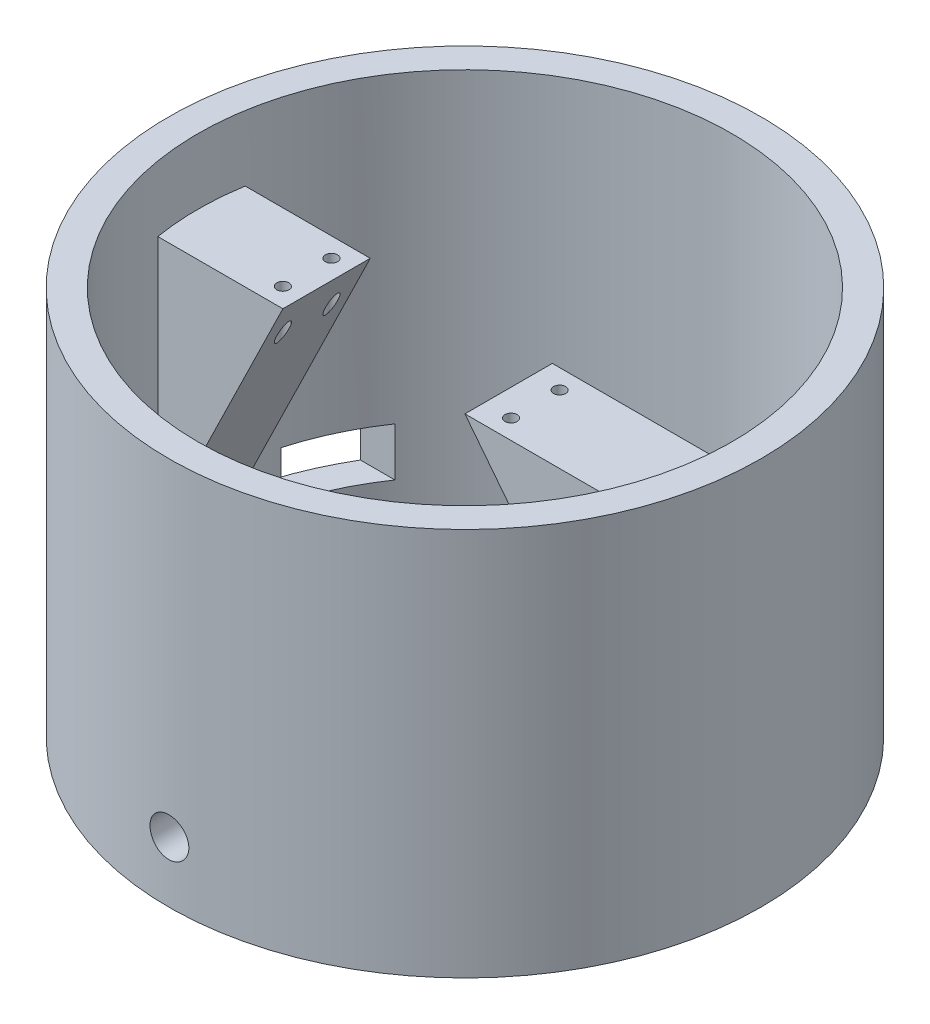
ISO-10303-21;
HEADER;
FILE_DESCRIPTION(('STEP AP214'),'2;1');
FILE_NAME('part.step','',(''),(''),'','','');
FILE_SCHEMA(('AUTOMOTIVE_DESIGN { 1 0 10303 214 1 1 1 1 }'));
ENDSEC;
DATA;
#1=APPLICATION_CONTEXT('core data for automotive mechanical design processes');
#2=APPLICATION_PROTOCOL_DEFINITION('international standard','automotive_design',2000,#1);
#3=PRODUCT_CONTEXT('',#1,'mechanical');
#4=PRODUCT('Part','Part','',(#3));
#5=PRODUCT_RELATED_PRODUCT_CATEGORY('part','',(#4));
#6=PRODUCT_DEFINITION_FORMATION('','',#4);
#7=PRODUCT_DEFINITION_CONTEXT('part definition',#1,'design');
#8=PRODUCT_DEFINITION('design','',#6,#7);
#9=PRODUCT_DEFINITION_SHAPE('','',#8);
#10=(LENGTH_UNIT() NAMED_UNIT(*) SI_UNIT(.MILLI.,.METRE.));
#11=(NAMED_UNIT(*) PLANE_ANGLE_UNIT() SI_UNIT($,.RADIAN.));
#12=(NAMED_UNIT(*) SI_UNIT($,.STERADIAN.) SOLID_ANGLE_UNIT());
#13=UNCERTAINTY_MEASURE_WITH_UNIT(LENGTH_MEASURE(1.E-05),#10,'distance_accuracy_value','');
#14=(GEOMETRIC_REPRESENTATION_CONTEXT(3) GLOBAL_UNCERTAINTY_ASSIGNED_CONTEXT((#13)) GLOBAL_UNIT_ASSIGNED_CONTEXT((#10,
#11,#12)) REPRESENTATION_CONTEXT('',''));
#15=CARTESIAN_POINT('',(0.,0.,0.));
#16=DIRECTION('',(0.,0.,1.));
#17=DIRECTION('',(1.,0.,0.));
#18=AXIS2_PLACEMENT_3D('',#15,#16,#17);
#19=CARTESIAN_POINT('',(0.,80.,0.));
#20=DIRECTION('',(0.,-1.,0.));
#21=DIRECTION('',(0.,0.,-1.));
#22=AXIS2_PLACEMENT_3D('',#19,#20,#21);
#23=CYLINDRICAL_SURFACE('',#22,61.);
#24=CARTESIAN_POINT('',(-4.,12.5,60.8687111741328));
#25=CARTESIAN_POINT('',(-3.99999013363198,12.7244224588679,60.8687129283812));
#26=CARTESIAN_POINT('',(-3.98104948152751,12.9490014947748,60.8699656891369));
#27=CARTESIAN_POINT('',(-3.90576427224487,13.3919567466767,60.8748418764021));
#28=CARTESIAN_POINT('',(-3.84937632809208,13.6103254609,60.8784680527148));
#29=CARTESIAN_POINT('',(-3.70082460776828,14.0343797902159,60.8876785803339));
#30=CARTESIAN_POINT('',(-3.60867989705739,14.2400720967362,60.8932618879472));
#31=CARTESIAN_POINT('',(-3.39126155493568,14.6330170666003,60.905756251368));
#32=CARTESIAN_POINT('',(-3.26599544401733,14.8202739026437,60.91266700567));
#33=CARTESIAN_POINT('',(-2.9856654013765,15.1713928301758,60.9270503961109));
#34=CARTESIAN_POINT('',(-2.8305585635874,15.3352206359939,60.93452383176));
#35=CARTESIAN_POINT('',(-2.4950389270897,15.6345374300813,60.9491830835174));
#36=CARTESIAN_POINT('',(-2.31462506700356,15.7700252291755,60.9563688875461));
#37=CARTESIAN_POINT('',(-1.93341783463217,16.0089224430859,60.9696502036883));
#38=CARTESIAN_POINT('',(-1.73260655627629,16.1123033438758,60.9757447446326));
#39=CARTESIAN_POINT('',(-1.31643027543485,16.2838696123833,60.9861483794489));
#40=CARTESIAN_POINT('',(-1.10106544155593,16.3520553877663,60.9904574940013));
#41=CARTESIAN_POINT('',(-0.662227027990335,16.4512003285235,60.9967992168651));
#42=CARTESIAN_POINT('',(-0.438765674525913,16.4822133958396,60.9988351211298));
#43=CARTESIAN_POINT('',(0.0101996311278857,16.5062990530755,61.0004121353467));
#44=CARTESIAN_POINT('',(0.235703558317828,16.4993721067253,60.9999532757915));
#45=CARTESIAN_POINT('',(0.681987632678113,16.4478187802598,60.9965952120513));
#46=CARTESIAN_POINT('',(0.902774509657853,16.4032503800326,60.9936997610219));
#47=CARTESIAN_POINT('',(1.33372655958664,16.2777692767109,60.9857987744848));
#48=CARTESIAN_POINT('',(1.54389166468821,16.1968563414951,60.9807932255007));
#49=CARTESIAN_POINT('',(1.94782026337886,16.000917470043,60.9692291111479));
#50=CARTESIAN_POINT('',(2.14157099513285,15.8858652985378,60.9626693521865));
#51=CARTESIAN_POINT('',(2.50703161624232,15.6249329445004,60.948734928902));
#52=CARTESIAN_POINT('',(2.6787412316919,15.4790523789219,60.941360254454));
#53=CARTESIAN_POINT('',(2.99558389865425,15.1602768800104,60.9266094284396));
#54=CARTESIAN_POINT('',(3.14066631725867,14.9873316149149,60.9192333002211));
#55=CARTESIAN_POINT('',(3.39974574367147,14.6195122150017,60.905325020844));
#56=CARTESIAN_POINT('',(3.51374273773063,14.4246380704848,60.8987928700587));
#57=CARTESIAN_POINT('',(3.70741196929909,14.0184600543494,60.8873102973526));
#58=CARTESIAN_POINT('',(3.78708201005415,13.8071551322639,60.8823599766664));
#59=CARTESIAN_POINT('',(3.90980050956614,13.37412877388,60.8746028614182));
#60=CARTESIAN_POINT('',(3.95284944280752,13.1524074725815,60.871796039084));
#61=CARTESIAN_POINT('',(4.0010405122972,12.7052840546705,60.8686476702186));
#62=CARTESIAN_POINT('',(4.00625306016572,12.4798895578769,60.868301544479));
#63=CARTESIAN_POINT('',(3.97880742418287,12.0314295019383,60.8701016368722));
#64=CARTESIAN_POINT('',(3.9461494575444,11.8083639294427,60.8722478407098));
#65=CARTESIAN_POINT('',(3.84394834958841,11.3710932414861,60.8787865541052));
#66=CARTESIAN_POINT('',(3.77443769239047,11.1568805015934,60.8831770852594));
#67=CARTESIAN_POINT('',(3.60053727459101,10.743160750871,60.8937080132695));
#68=CARTESIAN_POINT('',(3.496147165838,10.5436538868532,60.8998484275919));
#69=CARTESIAN_POINT('',(3.25527139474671,10.164685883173,60.9131982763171));
#70=CARTESIAN_POINT('',(3.11873858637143,9.98525476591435,60.9204092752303));
#71=CARTESIAN_POINT('',(2.81752163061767,9.65183421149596,60.9350822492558));
#72=CARTESIAN_POINT('',(2.65283718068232,9.49784504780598,60.9425442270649));
#73=CARTESIAN_POINT('',(2.29968852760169,9.21944142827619,60.9568917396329));
#74=CARTESIAN_POINT('',(2.1111883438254,9.09507256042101,60.9637763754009));
#75=CARTESIAN_POINT('',(1.71593977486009,8.87975197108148,60.976180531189));
#76=CARTESIAN_POINT('',(1.50919151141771,8.78880002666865,60.9817000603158));
#77=CARTESIAN_POINT('',(1.08348265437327,8.64297424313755,60.9907478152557));
#78=CARTESIAN_POINT('',(0.864531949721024,8.58807163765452,60.9942776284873));
#79=CARTESIAN_POINT('',(0.420496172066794,8.51580888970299,60.9989545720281));
#80=CARTESIAN_POINT('',(0.195411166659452,8.49844833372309,61.0001017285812));
#81=CARTESIAN_POINT('',(-0.254052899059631,8.50176658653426,60.9998841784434));
#82=CARTESIAN_POINT('',(-0.478432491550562,8.52237409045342,60.9985241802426));
#83=CARTESIAN_POINT('',(-0.920538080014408,8.60089553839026,60.9934545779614));
#84=CARTESIAN_POINT('',(-1.13826406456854,8.65880954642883,60.9897449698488));
#85=CARTESIAN_POINT('',(-1.56089185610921,8.81028364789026,60.9803930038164));
#86=CARTESIAN_POINT('',(-1.76579381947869,8.90384330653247,60.9747506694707));
#87=CARTESIAN_POINT('',(-2.15699099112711,9.12394331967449,60.9621664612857));
#88=CARTESIAN_POINT('',(-2.34328665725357,9.25048286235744,60.9552246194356));
#89=CARTESIAN_POINT('',(-2.69234531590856,9.53321511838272,60.9408065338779));
#90=CARTESIAN_POINT('',(-2.85506631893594,9.68945962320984,60.933329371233));
#91=CARTESIAN_POINT('',(-3.15202761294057,10.0270924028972,60.9186908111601));
#92=CARTESIAN_POINT('',(-3.28626093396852,10.2084868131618,60.9115294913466));
#93=CARTESIAN_POINT('',(-3.52254630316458,10.5914960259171,60.8983229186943));
#94=CARTESIAN_POINT('',(-3.62455559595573,10.7931372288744,60.8922791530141));
#95=CARTESIAN_POINT('',(-3.79314514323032,11.2105790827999,60.8820108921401));
#96=CARTESIAN_POINT('',(-3.85976679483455,11.4263628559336,60.8777842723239));
#97=CARTESIAN_POINT('',(-3.93841916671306,11.786217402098,60.872733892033));
#98=CARTESIAN_POINT('',(-3.96148200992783,11.9279634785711,60.8712321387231));
#99=CARTESIAN_POINT('',(-3.99227556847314,12.2131183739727,60.8692202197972));
#100=CARTESIAN_POINT('',(-4.00000630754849,12.3565271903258,60.8687100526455));
#101=CARTESIAN_POINT('',(-4.,12.5,60.8687111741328));
#102=B_SPLINE_CURVE_WITH_KNOTS('',3,(#24,#25,#26,#27,#28,#29,#30,#31,#32,#33,#34,#35,#36,#37,
#38,#39,#40,#41,#42,#43,#44,#45,#46,#47,#48,#49,#50,#51,#52,#53,#54,#55,#56,#57,#58,#59,#60,#61,
#62,#63,#64,#65,#66,#67,#68,#69,#70,#71,#72,#73,#74,#75,#76,#77,#78,#79,#80,#81,#82,#83,#84,#85,
#86,#87,#88,#89,#90,#91,#92,#93,#94,#95,#96,#97,#98,#99,#100,#101),.UNSPECIFIED.,.T.,.F.,(4,2,2,
2,2,2,2,2,2,2,2,2,2,2,2,2,2,2,2,2,2,2,2,2,2,2,2,2,2,2,2,2,2,2,2,2,2,2,4),(0.,0.672743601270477,
1.346268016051,2.01943380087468,2.69244686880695,3.36643495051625,4.04045130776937,
4.71506455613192,5.38966999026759,6.06329603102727,6.73691383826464,7.40949594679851,
8.08208235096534,8.75518696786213,9.42829994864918,10.10267991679,10.7770601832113,
11.4514836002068,12.1258982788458,12.7990575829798,13.4722130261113,14.1447760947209,
14.8173458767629,15.4909083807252,16.1644781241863,16.8390779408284,17.513673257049,
18.1877296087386,18.8617785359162,19.5345628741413,20.2073483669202,20.8801256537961,
21.5528863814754,22.2268310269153,22.9009403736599,23.5759404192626,24.2501490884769,
24.6802333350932,25.1103169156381),.UNSPECIFIED.);
#103=CARTESIAN_POINT('',(-4.,12.5,60.8687111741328));
#104=VERTEX_POINT('',#103);
#105=EDGE_CURVE('E179',#104,#104,#102,.T.);
#106=ORIENTED_EDGE('',*,*,#105,.T.);
#107=EDGE_LOOP('',(#106));
#108=FACE_BOUND('',#107,.T.);
#109=CARTESIAN_POINT('',(0.,80.,0.));
#110=DIRECTION('',(0.,1.,0.));
#111=DIRECTION('',(1.,0.,0.));
#112=AXIS2_PLACEMENT_3D('',#109,#110,#111);
#113=CIRCLE('',#112,61.);
#114=CARTESIAN_POINT('',(61.,80.,0.));
#115=VERTEX_POINT('',#114);
#116=EDGE_CURVE('E286',#115,#115,#113,.T.);
#117=ORIENTED_EDGE('',*,*,#116,.F.);
#118=EDGE_LOOP('',(#117));
#119=FACE_BOUND('',#118,.T.);
#120=CARTESIAN_POINT('',(0.,0.,0.));
#121=DIRECTION('',(0.,1.,0.));
#122=DIRECTION('',(1.,0.,0.));
#123=AXIS2_PLACEMENT_3D('',#120,#121,#122);
#124=CIRCLE('',#123,61.);
#125=CARTESIAN_POINT('',(61.,0.,0.));
#126=VERTEX_POINT('',#125);
#127=EDGE_CURVE('E289',#126,#126,#124,.T.);
#128=ORIENTED_EDGE('',*,*,#127,.T.);
#129=EDGE_LOOP('',(#128));
#130=FACE_BOUND('',#129,.T.);
#131=DIRECTION('',(0.,-1.,0.));
#132=VECTOR('',#131,1.);
#133=CARTESIAN_POINT('',(-59.1269819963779,80.,-15.));
#134=LINE('',#133,#132);
#135=CARTESIAN_POINT('',(-59.1269819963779,7.49999999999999,-15.));
#136=VERTEX_POINT('',#135);
#137=CARTESIAN_POINT('',(-59.1269819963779,17.5,-15.));
#138=VERTEX_POINT('',#137);
#139=EDGE_CURVE('E176',#136,#138,#134,.F.);
#140=ORIENTED_EDGE('',*,*,#139,.F.);
#141=CARTESIAN_POINT('',(0.,7.49999999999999,0.));
#142=DIRECTION('',(0.,1.,0.));
#143=DIRECTION('',(0.,0.,1.));
#144=AXIS2_PLACEMENT_3D('',#141,#142,#143);
#145=CIRCLE('',#144,61.);
#146=CARTESIAN_POINT('',(-52.5357021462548,7.49999999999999,-31.));
#147=VERTEX_POINT('',#146);
#148=EDGE_CURVE('E165',#147,#136,#145,.T.);
#149=ORIENTED_EDGE('',*,*,#148,.F.);
#150=DIRECTION('',(0.,-1.,0.));
#151=VECTOR('',#150,1.);
#152=CARTESIAN_POINT('',(-52.5357021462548,80.,-31.));
#153=LINE('',#152,#151);
#154=CARTESIAN_POINT('',(-52.5357021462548,17.5,-31.));
#155=VERTEX_POINT('',#154);
#156=EDGE_CURVE('E170',#155,#147,#153,.T.);
#157=ORIENTED_EDGE('',*,*,#156,.F.);
#158=CARTESIAN_POINT('',(0.,17.5,0.));
#159=DIRECTION('',(0.,-1.,0.));
#160=DIRECTION('',(0.,0.,-1.));
#161=AXIS2_PLACEMENT_3D('',#158,#159,#160);
#162=CIRCLE('',#161,61.);
#163=EDGE_CURVE('E182',#138,#155,#162,.T.);
#164=ORIENTED_EDGE('',*,*,#163,.F.);
#165=EDGE_LOOP('',(#140,#149,#157,#164));
#166=FACE_BOUND('',#165,.T.);
#167=ADVANCED_FACE('F77',(#108,#119,#130,#166),#23,.T.);
#168=CARTESIAN_POINT('',(0.,80.,0.));
#169=DIRECTION('',(0.,-1.,0.));
#170=DIRECTION('',(0.,0.,-1.));
#171=AXIS2_PLACEMENT_3D('',#168,#169,#170);
#172=CYLINDRICAL_SURFACE('',#171,55.);
#173=CARTESIAN_POINT('',(-4.,12.5,54.8543526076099));
#174=CARTESIAN_POINT('',(-3.99999015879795,12.724362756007,54.8543545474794));
#175=CARTESIAN_POINT('',(-3.98105953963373,12.9488806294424,54.8557439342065));
#176=CARTESIAN_POINT('',(-3.90581651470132,13.3917111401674,54.8611516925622));
#177=CARTESIAN_POINT('',(-3.84946112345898,13.6100163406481,54.8651730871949));
#178=CARTESIAN_POINT('',(-3.70100094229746,14.0339433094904,54.8753869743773));
#179=CARTESIAN_POINT('',(-3.60891565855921,14.2395719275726,54.8815782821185));
#180=CARTESIAN_POINT('',(-3.39164268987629,14.6324020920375,54.8954328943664));
#181=CARTESIAN_POINT('',(-3.26646235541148,14.8196077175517,54.903095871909));
#182=CARTESIAN_POINT('',(-2.98628221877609,15.1707014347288,54.9190475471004));
#183=CARTESIAN_POINT('',(-2.83123037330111,15.3345479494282,54.9273373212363));
#184=CARTESIAN_POINT('',(-2.49581753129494,15.6339158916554,54.9435986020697));
#185=CARTESIAN_POINT('',(-2.31545545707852,15.7694361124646,54.9515700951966));
#186=CARTESIAN_POINT('',(-1.93430016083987,16.0084379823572,54.9663064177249));
#187=CARTESIAN_POINT('',(-1.7334847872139,16.1118843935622,54.973069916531));
#188=CARTESIAN_POINT('',(-1.31727825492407,16.2835767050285,54.9846166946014));
#189=CARTESIAN_POINT('',(-1.10188729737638,16.3518230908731,54.9894000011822));
#190=CARTESIAN_POINT('',(-0.663051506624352,16.4510604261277,54.9964399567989));
#191=CARTESIAN_POINT('',(-0.439621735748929,16.4821176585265,54.9987011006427));
#192=CARTESIAN_POINT('',(0.00929016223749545,16.5062998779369,55.0004571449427));
#193=CARTESIAN_POINT('',(0.2347722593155,16.499425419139,54.9999520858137));
#194=CARTESIAN_POINT('',(0.680939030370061,16.4479938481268,54.9962363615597));
#195=CARTESIAN_POINT('',(0.901631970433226,16.403508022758,54.9930308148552));
#196=CARTESIAN_POINT('',(1.33240998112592,16.2782272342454,54.9842807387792));
#197=CARTESIAN_POINT('',(1.54249497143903,16.1974319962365,54.9787361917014));
#198=CARTESIAN_POINT('',(1.94632148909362,16.0017457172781,54.9659233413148));
#199=CARTESIAN_POINT('',(2.14004739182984,15.8868225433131,54.9586534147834));
#200=CARTESIAN_POINT('',(2.50548598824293,15.6261659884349,54.9432074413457));
#201=CARTESIAN_POINT('',(2.67719834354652,15.4804321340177,54.9350313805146));
#202=CARTESIAN_POINT('',(2.99415196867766,15.1618888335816,54.9186703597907));
#203=CARTESIAN_POINT('',(3.1393310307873,14.989017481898,54.9104854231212));
#204=CARTESIAN_POINT('',(3.39861689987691,14.6213227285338,54.8950483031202));
#205=CARTESIAN_POINT('',(3.51272368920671,14.4264993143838,54.8877961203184));
#206=CARTESIAN_POINT('',(3.70662245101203,14.020389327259,54.8750438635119));
#207=CARTESIAN_POINT('',(3.78641152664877,13.8091013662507,54.8695439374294));
#208=CARTESIAN_POINT('',(3.90936558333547,13.3760793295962,54.8609213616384));
#209=CARTESIAN_POINT('',(3.95253114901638,13.1543454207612,54.8577986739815));
#210=CARTESIAN_POINT('',(4.00093480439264,12.7072691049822,54.8542899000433));
#211=CARTESIAN_POINT('',(4.00625949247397,12.4819361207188,54.8538975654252));
#212=CARTESIAN_POINT('',(3.97905677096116,12.0335804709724,54.8558774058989));
#213=CARTESIAN_POINT('',(3.94652962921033,11.8105577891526,54.8582495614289));
#214=CARTESIAN_POINT('',(3.84461862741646,11.3734001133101,54.8654853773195));
#215=CARTESIAN_POINT('',(3.77527489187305,11.1592557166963,54.8703463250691));
#216=CARTESIAN_POINT('',(3.6017398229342,10.7456426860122,54.8820097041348));
#217=CARTESIAN_POINT('',(3.49754806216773,10.5461742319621,54.8888121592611));
#218=CARTESIAN_POINT('',(3.25705425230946,10.1671781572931,54.9036071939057));
#219=CARTESIAN_POINT('',(3.12069432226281,9.98768734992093,54.9116019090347));
#220=CARTESIAN_POINT('',(2.81981887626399,9.65411305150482,54.9278732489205));
#221=CARTESIAN_POINT('',(2.6553029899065,9.50002989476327,54.9361498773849));
#222=CARTESIAN_POINT('',(2.30241223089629,9.22135083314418,54.9520708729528));
#223=CARTESIAN_POINT('',(2.11399296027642,9.09681107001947,54.9597140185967));
#224=CARTESIAN_POINT('',(1.71886627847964,8.88113865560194,54.973489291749));
#225=CARTESIAN_POINT('',(1.51215901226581,8.79000573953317,54.9796214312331));
#226=CARTESIAN_POINT('',(1.08652801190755,8.64383104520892,54.9896780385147));
#227=CARTESIAN_POINT('',(0.867616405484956,8.5887541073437,54.9936046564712));
#228=CARTESIAN_POINT('',(0.423623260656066,8.51613980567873,54.9988164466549));
#229=CARTESIAN_POINT('',(0.19854180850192,8.49860191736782,55.0001016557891));
#230=CARTESIAN_POINT('',(-0.250847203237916,8.50156905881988,54.9998859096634));
#231=CARTESIAN_POINT('',(-0.475155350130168,8.52198639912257,54.9983913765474));
#232=CARTESIAN_POINT('',(-0.917148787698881,8.60010212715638,54.9927968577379));
#233=CARTESIAN_POINT('',(-1.13483406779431,8.65780057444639,54.9886968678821));
#234=CARTESIAN_POINT('',(-1.55741202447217,8.80881964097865,54.9783518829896));
#235=CARTESIAN_POINT('',(-1.76230504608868,8.90213929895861,54.9721069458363));
#236=CARTESIAN_POINT('',(-2.15352847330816,9.12174087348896,54.9581720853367));
#237=CARTESIAN_POINT('',(-2.33985927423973,9.24802208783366,54.9504821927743));
#238=CARTESIAN_POINT('',(-2.68911631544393,9.5302896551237,54.9345004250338));
#239=CARTESIAN_POINT('',(-2.85199052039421,9.68634031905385,54.926207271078));
#240=CARTESIAN_POINT('',(-3.14929306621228,10.0236128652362,54.9099643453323));
#241=CARTESIAN_POINT('',(-3.28371447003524,10.2048408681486,54.9020146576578));
#242=CARTESIAN_POINT('',(-3.52043217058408,10.5875958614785,54.8873454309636));
#243=CARTESIAN_POINT('',(-3.62267916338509,10.7891533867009,54.8806277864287));
#244=CARTESIAN_POINT('',(-3.79175205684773,11.2064814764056,54.86920688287));
#245=CARTESIAN_POINT('',(-3.85861909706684,11.4222352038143,54.8645012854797));
#246=CARTESIAN_POINT('',(-3.93781302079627,11.7827399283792,54.8588600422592));
#247=CARTESIAN_POINT('',(-3.96110260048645,11.925165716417,54.8571774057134));
#248=CARTESIAN_POINT('',(-3.99219923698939,12.2117063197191,54.8549230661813));
#249=CARTESIAN_POINT('',(-4.00000632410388,12.3558211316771,54.8543513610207));
#250=CARTESIAN_POINT('',(-4.,12.5,54.8543526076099));
#251=B_SPLINE_CURVE_WITH_KNOTS('',3,(#173,#174,#175,#176,#177,#178,#179,#180,#181,#182,#183,
#184,#185,#186,#187,#188,#189,#190,#191,#192,#193,#194,#195,#196,#197,#198,#199,#200,#201,#202,
#203,#204,#205,#206,#207,#208,#209,#210,#211,#212,#213,#214,#215,#216,#217,#218,#219,#220,#221,
#222,#223,#224,#225,#226,#227,#228,#229,#230,#231,#232,#233,#234,#235,#236,#237,#238,#239,#240,
#241,#242,#243,#244,#245,#246,#247,#248,#249,#250),.UNSPECIFIED.,.T.,.F.,(4,2,2,2,2,2,2,2,2,2,2,
2,2,2,2,2,2,2,2,2,2,2,2,2,2,2,2,2,2,2,2,2,2,2,2,2,2,2,4),(0.,0.672561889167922,1.3458976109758,
2.01886625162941,2.69168554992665,3.36568783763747,4.03971883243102,4.71448774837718,
5.38924735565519,6.06280252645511,6.73634785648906,7.4086194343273,8.08089610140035,
8.75380776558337,9.42672977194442,10.1012097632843,10.7756901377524,11.4502274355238,
12.124753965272,12.7977363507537,13.4707139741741,14.1429596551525,14.8152135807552,
15.4886864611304,16.1621682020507,16.8369196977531,17.5116658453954,18.185753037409,
18.8598308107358,19.5323531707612,20.2048766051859,20.8773818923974,21.5498728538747,
22.2238333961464,22.8979580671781,23.5731107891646,24.2474767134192,24.6796759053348,
25.1118742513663),.UNSPECIFIED.);
#252=CARTESIAN_POINT('',(-4.,12.5,54.8543526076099));
#253=VERTEX_POINT('',#252);
#254=EDGE_CURVE('E327',#253,#253,#251,.T.);
#255=ORIENTED_EDGE('',*,*,#254,.F.);
#256=EDGE_LOOP('',(#255));
#257=FACE_BOUND('',#256,.T.);
#258=DIRECTION('',(0.,-1.,0.));
#259=VECTOR('',#258,1.);
#260=CARTESIAN_POINT('',(54.2586398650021,80.,9.));
#261=LINE('',#260,#259);
#262=CARTESIAN_POINT('',(54.2586398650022,8.62116248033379,9.));
#263=VERTEX_POINT('',#262);
#264=CARTESIAN_POINT('',(54.2586398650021,66.5,9.));
#265=VERTEX_POINT('',#264);
#266=EDGE_CURVE('E318',#263,#265,#261,.F.);
#267=ORIENTED_EDGE('',*,*,#266,.F.);
#268=CARTESIAN_POINT('',(0.,78.0096153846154,0.));
#269=DIRECTION('',(0.787754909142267,0.615988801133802,0.));
#270=DIRECTION('',(0.615988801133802,-0.787754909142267,0.));
#271=AXIS2_PLACEMENT_3D('',#268,#269,#270);
#272=ELLIPSE('',#271,89.2873375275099,55.);
#273=CARTESIAN_POINT('',(54.2586398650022,8.62116248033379,-9.));
#274=VERTEX_POINT('',#273);
#275=EDGE_CURVE('E200',#263,#274,#272,.T.);
#276=ORIENTED_EDGE('',*,*,#275,.T.);
#277=DIRECTION('',(0.,-1.,0.));
#278=VECTOR('',#277,1.);
#279=CARTESIAN_POINT('',(54.2586398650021,80.,-9.));
#280=LINE('',#279,#278);
#281=CARTESIAN_POINT('',(54.2586398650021,66.5,-9.));
#282=VERTEX_POINT('',#281);
#283=EDGE_CURVE('E312',#274,#282,#280,.F.);
#284=ORIENTED_EDGE('',*,*,#283,.T.);
#285=CARTESIAN_POINT('',(0.,66.5,0.));
#286=DIRECTION('',(0.,-1.,0.));
#287=DIRECTION('',(0.,0.,-1.));
#288=AXIS2_PLACEMENT_3D('',#285,#286,#287);
#289=CIRCLE('',#288,55.);
#290=EDGE_CURVE('E315',#282,#265,#289,.T.);
#291=ORIENTED_EDGE('',*,*,#290,.T.);
#292=EDGE_LOOP('',(#267,#276,#284,#291));
#293=FACE_BOUND('',#292,.T.);
#294=CARTESIAN_POINT('',(0.,80.,0.));
#295=DIRECTION('',(0.,1.,0.));
#296=DIRECTION('',(0.,0.,1.));
#297=AXIS2_PLACEMENT_3D('',#294,#295,#296);
#298=CIRCLE('',#297,55.);
#299=CARTESIAN_POINT('',(0.,80.,55.));
#300=VERTEX_POINT('',#299);
#301=EDGE_CURVE('E291',#300,#300,#298,.T.);
#302=ORIENTED_EDGE('',*,*,#301,.T.);
#303=EDGE_LOOP('',(#302));
#304=FACE_BOUND('',#303,.T.);
#305=CARTESIAN_POINT('',(0.,0.,0.));
#306=DIRECTION('',(0.,1.,0.));
#307=DIRECTION('',(0.,0.,1.));
#308=AXIS2_PLACEMENT_3D('',#305,#306,#307);
#309=CIRCLE('',#308,55.);
#310=CARTESIAN_POINT('',(0.,0.,55.));
#311=VERTEX_POINT('',#310);
#312=EDGE_CURVE('E296',#311,#311,#309,.T.);
#313=ORIENTED_EDGE('',*,*,#312,.F.);
#314=EDGE_LOOP('',(#313));
#315=FACE_BOUND('',#314,.T.);
#316=CARTESIAN_POINT('',(0.,124.815384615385,0.));
#317=DIRECTION('',(-0.898443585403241,0.439088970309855,0.));
#318=DIRECTION('',(-0.439088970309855,-0.898443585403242,0.));
#319=AXIS2_PLACEMENT_3D('',#316,#317,#318);
#320=ELLIPSE('',#319,125.259352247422,55.);
#321=CARTESIAN_POINT('',(-54.2586398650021,13.7938599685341,-9.));
#322=VERTEX_POINT('',#321);
#323=CARTESIAN_POINT('',(-54.2586398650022,13.793859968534,9.));
#324=VERTEX_POINT('',#323);
#325=EDGE_CURVE('E224',#322,#324,#320,.T.);
#326=ORIENTED_EDGE('',*,*,#325,.T.);
#327=DIRECTION('',(0.,-1.,0.));
#328=VECTOR('',#327,1.);
#329=CARTESIAN_POINT('',(-54.2586398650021,80.,9.));
#330=LINE('',#329,#328);
#331=CARTESIAN_POINT('',(-54.2586398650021,66.5,9.));
#332=VERTEX_POINT('',#331);
#333=EDGE_CURVE('E307',#324,#332,#330,.F.);
#334=ORIENTED_EDGE('',*,*,#333,.T.);
#335=CARTESIAN_POINT('',(0.,66.5,0.));
#336=DIRECTION('',(0.,-1.,0.));
#337=DIRECTION('',(0.,0.,-1.));
#338=AXIS2_PLACEMENT_3D('',#335,#336,#337);
#339=CIRCLE('',#338,55.);
#340=CARTESIAN_POINT('',(-54.2586398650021,66.5,-9.));
#341=VERTEX_POINT('',#340);
#342=EDGE_CURVE('E305',#332,#341,#339,.T.);
#343=ORIENTED_EDGE('',*,*,#342,.T.);
#344=DIRECTION('',(0.,-1.,0.));
#345=VECTOR('',#344,1.);
#346=CARTESIAN_POINT('',(-54.2586398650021,80.,-9.));
#347=LINE('',#346,#345);
#348=EDGE_CURVE('E302',#322,#341,#347,.F.);
#349=ORIENTED_EDGE('',*,*,#348,.F.);
#350=EDGE_LOOP('',(#326,#334,#343,#349));
#351=FACE_BOUND('',#350,.T.);
#352=CARTESIAN_POINT('',(0.,7.49999999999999,0.));
#353=DIRECTION('',(0.,1.,0.));
#354=DIRECTION('',(0.,0.,1.));
#355=AXIS2_PLACEMENT_3D('',#352,#353,#354);
#356=CIRCLE('',#355,55.);
#357=CARTESIAN_POINT('',(-45.4312667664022,7.49999999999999,-31.));
#358=VERTEX_POINT('',#357);
#359=CARTESIAN_POINT('',(-52.9150262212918,7.49999999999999,-15.));
#360=VERTEX_POINT('',#359);
#361=EDGE_CURVE('E320',#358,#360,#356,.T.);
#362=ORIENTED_EDGE('',*,*,#361,.T.);
#363=DIRECTION('',(0.,-1.,0.));
#364=VECTOR('',#363,1.);
#365=CARTESIAN_POINT('',(-52.9150262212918,80.,-15.));
#366=LINE('',#365,#364);
#367=CARTESIAN_POINT('',(-52.9150262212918,17.5,-15.));
#368=VERTEX_POINT('',#367);
#369=EDGE_CURVE('E12',#360,#368,#366,.F.);
#370=ORIENTED_EDGE('',*,*,#369,.T.);
#371=CARTESIAN_POINT('',(0.,17.5,0.));
#372=DIRECTION('',(0.,-1.,0.));
#373=DIRECTION('',(0.,0.,-1.));
#374=AXIS2_PLACEMENT_3D('',#371,#372,#373);
#375=CIRCLE('',#374,55.);
#376=CARTESIAN_POINT('',(-45.4312667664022,17.5,-31.));
#377=VERTEX_POINT('',#376);
#378=EDGE_CURVE('E86',#368,#377,#375,.T.);
#379=ORIENTED_EDGE('',*,*,#378,.T.);
#380=DIRECTION('',(0.,-1.,0.));
#381=VECTOR('',#380,1.);
#382=CARTESIAN_POINT('',(-45.4312667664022,80.,-31.));
#383=LINE('',#382,#381);
#384=EDGE_CURVE('E322',#377,#358,#383,.T.);
#385=ORIENTED_EDGE('',*,*,#384,.T.);
#386=EDGE_LOOP('',(#362,#370,#379,#385));
#387=FACE_BOUND('',#386,.T.);
#388=ADVANCED_FACE('F252',(#257,#293,#304,#315,#351,#387),#172,.F.);
#389=CARTESIAN_POINT('',(58.,0.,0.));
#390=DIRECTION('',(0.,-1.,0.));
#391=DIRECTION('',(0.,0.,-1.));
#392=AXIS2_PLACEMENT_3D('',#389,#390,#391);
#393=CYLINDRICAL_SURFACE('',#392,1.24999999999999);
#394=CARTESIAN_POINT('',(58.,0.,0.));
#395=DIRECTION('',(0.,-1.,0.));
#396=DIRECTION('',(0.,0.,-1.));
#397=AXIS2_PLACEMENT_3D('',#394,#395,#396);
#398=CIRCLE('',#397,1.24999999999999);
#399=CARTESIAN_POINT('',(58.,0.,-1.24999999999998));
#400=VERTEX_POINT('',#399);
#401=EDGE_CURVE('E413',#400,#400,#398,.T.);
#402=ORIENTED_EDGE('',*,*,#401,.T.);
#403=EDGE_LOOP('',(#402));
#404=FACE_BOUND('',#403,.T.);
#405=CARTESIAN_POINT('',(58.,3.83653846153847,0.));
#406=DIRECTION('',(0.787754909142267,0.615988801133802,0.));
#407=DIRECTION('',(0.615988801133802,-0.787754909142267,0.));
#408=AXIS2_PLACEMENT_3D('',#405,#406,#407);
#409=ELLIPSE('',#408,2.02925767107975,1.24999999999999);
#410=CARTESIAN_POINT('',(59.25,2.23798076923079,0.));
#411=VERTEX_POINT('',#410);
#412=EDGE_CURVE('E309',#411,#411,#409,.F.);
#413=ORIENTED_EDGE('',*,*,#412,.F.);
#414=EDGE_LOOP('',(#413));
#415=FACE_BOUND('',#414,.T.);
#416=ADVANCED_FACE('F249',(#404,#415),#393,.F.);
#417=CARTESIAN_POINT('',(-58.,7.50000000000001,0.));
#418=DIRECTION('',(0.,-1.,0.));
#419=DIRECTION('',(0.,0.,-1.));
#420=AXIS2_PLACEMENT_3D('',#417,#418,#419);
#421=CONICAL_SURFACE('',#420,1.24999999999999,1.02974425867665);
#422=CARTESIAN_POINT('',(-57.3346842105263,7.49979999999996,-1.05862512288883));
#423=CARTESIAN_POINT('',(-57.3281448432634,7.51318055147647,-1.02820845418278));
#424=CARTESIAN_POINT('',(-57.3217195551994,7.52632767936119,-0.997664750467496));
#425=CARTESIAN_POINT('',(-57.3091408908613,7.55206556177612,-0.936278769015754));
#426=CARTESIAN_POINT('',(-57.3029875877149,7.56465616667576,-0.905436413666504));
#427=CARTESIAN_POINT('',(-57.2849503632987,7.60156310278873,-0.812128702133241));
#428=CARTESIAN_POINT('',(-57.2735512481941,7.62488744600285,-0.749166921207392));
#429=CARTESIAN_POINT('',(-57.2526359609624,7.66768334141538,-0.622098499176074));
#430=CARTESIAN_POINT('',(-57.2431076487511,7.6871797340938,-0.558002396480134));
#431=CARTESIAN_POINT('',(-57.2265553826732,7.72104821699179,-0.428219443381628));
#432=CARTESIAN_POINT('',(-57.2195268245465,7.73542972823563,-0.362535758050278));
#433=CARTESIAN_POINT('',(-57.2102330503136,7.75444622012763,-0.248124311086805));
#434=CARTESIAN_POINT('',(-57.2071881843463,7.76067648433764,-0.199728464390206));
#435=CARTESIAN_POINT('',(-57.2030506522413,7.76914251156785,-0.102493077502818));
#436=CARTESIAN_POINT('',(-57.2019579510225,7.77137834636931,-0.0536535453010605));
#437=CARTESIAN_POINT('',(-57.201824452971,7.77165150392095,0.0440372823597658));
#438=CARTESIAN_POINT('',(-57.202783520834,7.76968910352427,0.0928885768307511));
#439=CARTESIAN_POINT('',(-57.2066651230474,7.76174674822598,0.190171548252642));
#440=CARTESIAN_POINT('',(-57.209587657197,7.75576679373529,0.238603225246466));
#441=CARTESIAN_POINT('',(-57.2186722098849,7.73717840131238,0.353879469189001));
#442=CARTESIAN_POINT('',(-57.2256604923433,7.72287930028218,0.420383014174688));
#443=CARTESIAN_POINT('',(-57.2422188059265,7.68899844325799,0.551774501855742));
#444=CARTESIAN_POINT('',(-57.2517939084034,7.66940631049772,0.616658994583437));
#445=CARTESIAN_POINT('',(-57.2728685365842,7.62628437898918,0.745322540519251));
#446=CARTESIAN_POINT('',(-57.2843821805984,7.60272569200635,0.809089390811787));
#447=CARTESIAN_POINT('',(-57.3026172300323,7.56541397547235,0.903567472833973));
#448=CARTESIAN_POINT('',(-57.3088397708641,7.55268169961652,0.934789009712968));
#449=CARTESIAN_POINT('',(-57.3215640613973,7.52664584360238,0.996925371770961));
#450=CARTESIAN_POINT('',(-57.3280657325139,7.51334242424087,1.02784028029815));
#451=CARTESIAN_POINT('',(-57.3346842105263,7.49980000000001,1.05862512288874));
#452=B_SPLINE_CURVE_WITH_KNOTS('',3,(#422,#423,#424,#425,#426,#427,#428,#429,#430,#431,#432,
#433,#434,#435,#436,#437,#438,#439,#440,#441,#442,#443,#444,#445,#446,#447,#448,#449,#450,#451),
.UNSPECIFIED.,.F.,.F.,(4,2,2,2,2,2,2,2,2,2,2,2,2,2,4),(0.,0.101598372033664,0.203223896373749,
0.407426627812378,0.610256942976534,0.812711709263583,0.959202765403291,1.10569118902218,
1.25216995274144,1.39864870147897,1.6034083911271,1.80857245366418,2.01530104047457,
2.11815774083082,2.2209856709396),.UNSPECIFIED.);
#453=CARTESIAN_POINT('',(-57.3345864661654,7.50000000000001,-1.05817051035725));
#454=VERTEX_POINT('',#453);
#455=CARTESIAN_POINT('',(-57.3345864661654,7.50000000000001,1.05817051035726));
#456=VERTEX_POINT('',#455);
#457=EDGE_CURVE('E216',#454,#456,#452,.T.);
#458=ORIENTED_EDGE('',*,*,#457,.F.);
#459=CARTESIAN_POINT('',(-58.,7.50000000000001,0.));
#460=DIRECTION('',(0.,-1.,0.));
#461=DIRECTION('',(0.,0.,-1.));
#462=AXIS2_PLACEMENT_3D('',#459,#460,#461);
#463=CIRCLE('',#462,1.24999999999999);
#464=EDGE_CURVE('E426',#454,#456,#463,.T.);
#465=ORIENTED_EDGE('',*,*,#464,.T.);
#466=EDGE_LOOP('',(#458,#465));
#467=FACE_BOUND('',#466,.T.);
#468=ADVANCED_FACE('F226',(#467),#421,.F.);
#469=CARTESIAN_POINT('',(-58.,0.,0.));
#470=DIRECTION('',(0.,-1.,0.));
#471=DIRECTION('',(0.,0.,-1.));
#472=AXIS2_PLACEMENT_3D('',#469,#470,#471);
#473=CYLINDRICAL_SURFACE('',#472,1.24999999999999);
#474=CARTESIAN_POINT('',(-58.,0.,0.));
#475=DIRECTION('',(0.,-1.,0.));
#476=DIRECTION('',(0.,0.,-1.));
#477=AXIS2_PLACEMENT_3D('',#474,#475,#476);
#478=CIRCLE('',#477,1.24999999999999);
#479=CARTESIAN_POINT('',(-58.,0.,-1.24999999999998));
#480=VERTEX_POINT('',#479);
#481=EDGE_CURVE('E424',#480,#480,#478,.T.);
#482=ORIENTED_EDGE('',*,*,#481,.T.);
#483=EDGE_LOOP('',(#482));
#484=FACE_BOUND('',#483,.T.);
#485=CARTESIAN_POINT('',(-58.,6.13846153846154,0.));
#486=DIRECTION('',(-0.898443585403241,0.439088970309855,0.));
#487=DIRECTION('',(-0.439088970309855,-0.898443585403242,0.));
#488=AXIS2_PLACEMENT_3D('',#485,#486,#487);
#489=ELLIPSE('',#488,2.84680346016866,1.24999999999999);
#490=EDGE_CURVE('E293',#456,#454,#489,.F.);
#491=ORIENTED_EDGE('',*,*,#490,.F.);
#492=ORIENTED_EDGE('',*,*,#464,.F.);
#493=EDGE_LOOP('',(#491,#492));
#494=FACE_BOUND('',#493,.T.);
#495=ADVANCED_FACE('F261',(#484,#494),#473,.F.);
#496=CARTESIAN_POINT('',(0.,80.,0.));
#497=DIRECTION('',(0.,1.,0.));
#498=DIRECTION('',(0.,0.,1.));
#499=AXIS2_PLACEMENT_3D('',#496,#497,#498);
#500=PLANE('',#499);
#501=ORIENTED_EDGE('',*,*,#116,.T.);
#502=EDGE_LOOP('',(#501));
#503=FACE_BOUND('',#502,.T.);
#504=ORIENTED_EDGE('',*,*,#301,.F.);
#505=EDGE_LOOP('',(#504));
#506=FACE_BOUND('',#505,.T.);
#507=ADVANCED_FACE('F263',(#503,#506),#500,.T.);
#508=CARTESIAN_POINT('',(0.,0.,0.));
#509=DIRECTION('',(0.,1.,0.));
#510=DIRECTION('',(0.,0.,1.));
#511=AXIS2_PLACEMENT_3D('',#508,#509,#510);
#512=PLANE('',#511);
#513=CARTESIAN_POINT('',(0.,0.,58.));
#514=DIRECTION('',(0.,-1.,0.));
#515=DIRECTION('',(0.,0.,-1.));
#516=AXIS2_PLACEMENT_3D('',#513,#514,#515);
#517=CIRCLE('',#516,1.24999999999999);
#518=CARTESIAN_POINT('',(0.,0.,56.75));
#519=VERTEX_POINT('',#518);
#520=EDGE_CURVE('E407',#519,#519,#517,.T.);
#521=ORIENTED_EDGE('',*,*,#520,.F.);
#522=EDGE_LOOP('',(#521));
#523=FACE_BOUND('',#522,.T.);
#524=ORIENTED_EDGE('',*,*,#401,.F.);
#525=EDGE_LOOP('',(#524));
#526=FACE_BOUND('',#525,.T.);
#527=CARTESIAN_POINT('',(0.,0.,-58.));
#528=DIRECTION('',(0.,-1.,0.));
#529=DIRECTION('',(0.,0.,-1.));
#530=AXIS2_PLACEMENT_3D('',#527,#528,#529);
#531=CIRCLE('',#530,1.24999999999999);
#532=CARTESIAN_POINT('',(0.,0.,-59.25));
#533=VERTEX_POINT('',#532);
#534=EDGE_CURVE('E418',#533,#533,#531,.T.);
#535=ORIENTED_EDGE('',*,*,#534,.F.);
#536=EDGE_LOOP('',(#535));
#537=FACE_BOUND('',#536,.T.);
#538=ORIENTED_EDGE('',*,*,#481,.F.);
#539=EDGE_LOOP('',(#538));
#540=FACE_BOUND('',#539,.T.);
#541=ORIENTED_EDGE('',*,*,#127,.F.);
#542=EDGE_LOOP('',(#541));
#543=FACE_BOUND('',#542,.T.);
#544=ORIENTED_EDGE('',*,*,#312,.T.);
#545=EDGE_LOOP('',(#544));
#546=FACE_BOUND('',#545,.T.);
#547=ADVANCED_FACE('F259',(#523,#526,#537,#540,#543,#546),#512,.F.);
#548=CARTESIAN_POINT('',(0.,7.50000000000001,-58.));
#549=DIRECTION('',(0.,-1.,0.));
#550=DIRECTION('',(0.,0.,-1.));
#551=AXIS2_PLACEMENT_3D('',#548,#549,#550);
#552=CONICAL_SURFACE('',#551,1.24999999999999,1.02974425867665);
#553=CARTESIAN_POINT('',(0.,8.25107577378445,-58.));
#554=VERTEX_POINT('',#553);
#555=VERTEX_LOOP('',#554);
#556=FACE_BOUND('',#555,.T.);
#557=CARTESIAN_POINT('',(0.,7.50000000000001,-58.));
#558=DIRECTION('',(0.,-1.,0.));
#559=DIRECTION('',(0.,0.,-1.));
#560=AXIS2_PLACEMENT_3D('',#557,#558,#559);
#561=CIRCLE('',#560,1.24999999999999);
#562=CARTESIAN_POINT('',(0.,7.50000000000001,-59.25));
#563=VERTEX_POINT('',#562);
#564=EDGE_CURVE('E421',#563,#563,#561,.T.);
#565=ORIENTED_EDGE('',*,*,#564,.T.);
#566=EDGE_LOOP('',(#565));
#567=FACE_BOUND('',#566,.T.);
#568=ADVANCED_FACE('F256',(#556,#567),#552,.F.);
#569=CARTESIAN_POINT('',(0.,0.,-58.));
#570=DIRECTION('',(0.,-1.,0.));
#571=DIRECTION('',(0.,0.,-1.));
#572=AXIS2_PLACEMENT_3D('',#569,#570,#571);
#573=CYLINDRICAL_SURFACE('',#572,1.24999999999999);
#574=ORIENTED_EDGE('',*,*,#564,.F.);
#575=EDGE_LOOP('',(#574));
#576=FACE_BOUND('',#575,.T.);
#577=ORIENTED_EDGE('',*,*,#534,.T.);
#578=EDGE_LOOP('',(#577));
#579=FACE_BOUND('',#578,.T.);
#580=ADVANCED_FACE('F247',(#576,#579),#573,.F.);
#581=CARTESIAN_POINT('',(0.,7.50000000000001,58.));
#582=DIRECTION('',(0.,-1.,0.));
#583=DIRECTION('',(0.,0.,-1.));
#584=AXIS2_PLACEMENT_3D('',#581,#582,#583);
#585=CONICAL_SURFACE('',#584,1.24999999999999,1.02974425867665);
#586=CARTESIAN_POINT('',(0.,8.25107577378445,58.));
#587=VERTEX_POINT('',#586);
#588=VERTEX_LOOP('',#587);
#589=FACE_BOUND('',#588,.T.);
#590=CARTESIAN_POINT('',(0.,7.50000000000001,58.));
#591=DIRECTION('',(0.,-1.,0.));
#592=DIRECTION('',(0.,0.,-1.));
#593=AXIS2_PLACEMENT_3D('',#590,#591,#592);
#594=CIRCLE('',#593,1.24999999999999);
#595=CARTESIAN_POINT('',(0.,7.50000000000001,56.75));
#596=VERTEX_POINT('',#595);
#597=EDGE_CURVE('E409',#596,#596,#594,.T.);
#598=ORIENTED_EDGE('',*,*,#597,.T.);
#599=EDGE_LOOP('',(#598));
#600=FACE_BOUND('',#599,.T.);
#601=ADVANCED_FACE('F243',(#589,#600),#585,.F.);
#602=CARTESIAN_POINT('',(0.,0.,58.));
#603=DIRECTION('',(0.,-1.,0.));
#604=DIRECTION('',(0.,0.,-1.));
#605=AXIS2_PLACEMENT_3D('',#602,#603,#604);
#606=CYLINDRICAL_SURFACE('',#605,1.24999999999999);
#607=ORIENTED_EDGE('',*,*,#597,.F.);
#608=EDGE_LOOP('',(#607));
#609=FACE_BOUND('',#608,.T.);
#610=ORIENTED_EDGE('',*,*,#520,.T.);
#611=EDGE_LOOP('',(#610));
#612=FACE_BOUND('',#611,.T.);
#613=ADVANCED_FACE('F240',(#609,#612),#606,.F.);
#614=CARTESIAN_POINT('',(-61.,0.,9.));
#615=DIRECTION('',(-0.898443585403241,0.439088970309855,0.));
#616=DIRECTION('',(-0.439088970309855,-0.898443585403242,0.));
#617=AXIS2_PLACEMENT_3D('',#614,#615,#616);
#618=PLANE('',#617);
#619=ORIENTED_EDGE('',*,*,#490,.T.);
#620=ORIENTED_EDGE('',*,*,#457,.T.);
#621=EDGE_LOOP('',(#619,#620));
#622=FACE_BOUND('',#621,.T.);
#623=ADVANCED_FACE('F238',(#622),#618,.F.);
#624=CARTESIAN_POINT('',(0.,0.,-9.));
#625=DIRECTION('',(0.,0.,-1.));
#626=DIRECTION('',(-1.,0.,0.));
#627=AXIS2_PLACEMENT_3D('',#624,#625,#626);
#628=PLANE('',#627);
#629=DIRECTION('',(0.439088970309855,0.898443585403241,0.));
#630=VECTOR('',#629,1.);
#631=CARTESIAN_POINT('',(-61.,0.,-9.));
#632=LINE('',#631,#630);
#633=CARTESIAN_POINT('',(-28.5,66.5,-9.));
#634=VERTEX_POINT('',#633);
#635=EDGE_CURVE('E203',#322,#634,#632,.T.);
#636=ORIENTED_EDGE('',*,*,#635,.F.);
#637=ORIENTED_EDGE('',*,*,#348,.T.);
#638=DIRECTION('',(-1.,0.,0.));
#639=VECTOR('',#638,1.);
#640=CARTESIAN_POINT('',(-28.5,66.5,-9.));
#641=LINE('',#640,#639);
#642=EDGE_CURVE('E207',#634,#341,#641,.T.);
#643=ORIENTED_EDGE('',*,*,#642,.F.);
#644=EDGE_LOOP('',(#636,#637,#643));
#645=FACE_BOUND('',#644,.T.);
#646=ADVANCED_FACE('F388',(#645),#628,.T.);
#647=CARTESIAN_POINT('',(0.,0.,9.));
#648=DIRECTION('',(0.,0.,-1.));
#649=DIRECTION('',(-1.,0.,0.));
#650=AXIS2_PLACEMENT_3D('',#647,#648,#649);
#651=PLANE('',#650);
#652=ORIENTED_EDGE('',*,*,#333,.F.);
#653=DIRECTION('',(0.439088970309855,0.898443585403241,0.));
#654=VECTOR('',#653,1.);
#655=CARTESIAN_POINT('',(-61.,0.,9.));
#656=LINE('',#655,#654);
#657=CARTESIAN_POINT('',(-28.5,66.5,9.));
#658=VERTEX_POINT('',#657);
#659=EDGE_CURVE('E204',#324,#658,#656,.T.);
#660=ORIENTED_EDGE('',*,*,#659,.T.);
#661=DIRECTION('',(-1.,0.,0.));
#662=VECTOR('',#661,1.);
#663=CARTESIAN_POINT('',(-28.5,66.5,9.));
#664=LINE('',#663,#662);
#665=EDGE_CURVE('E206',#658,#332,#664,.T.);
#666=ORIENTED_EDGE('',*,*,#665,.T.);
#667=EDGE_LOOP('',(#652,#660,#666));
#668=FACE_BOUND('',#667,.T.);
#669=ADVANCED_FACE('F386',(#668),#651,.F.);
#670=CARTESIAN_POINT('',(-28.5,66.5,9.));
#671=DIRECTION('',(0.,-1.,0.));
#672=DIRECTION('',(0.,0.,-1.));
#673=AXIS2_PLACEMENT_3D('',#670,#671,#672);
#674=PLANE('',#673);
#675=CARTESIAN_POINT('',(-32.5,66.5,-5.));
#676=DIRECTION('',(0.,1.,0.));
#677=DIRECTION('',(0.,0.,1.));
#678=AXIS2_PLACEMENT_3D('',#675,#676,#677);
#679=CIRCLE('',#678,1.24999999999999);
#680=CARTESIAN_POINT('',(-32.5,66.5,-3.75000000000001));
#681=VERTEX_POINT('',#680);
#682=EDGE_CURVE('E668',#681,#681,#679,.T.);
#683=ORIENTED_EDGE('',*,*,#682,.F.);
#684=EDGE_LOOP('',(#683));
#685=FACE_BOUND('',#684,.T.);
#686=CARTESIAN_POINT('',(-32.5,66.5,5.));
#687=DIRECTION('',(0.,1.,0.));
#688=DIRECTION('',(0.,0.,1.));
#689=AXIS2_PLACEMENT_3D('',#686,#687,#688);
#690=CIRCLE('',#689,1.24999999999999);
#691=CARTESIAN_POINT('',(-32.5,66.5,6.24999999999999));
#692=VERTEX_POINT('',#691);
#693=EDGE_CURVE('E665',#692,#692,#690,.T.);
#694=ORIENTED_EDGE('',*,*,#693,.F.);
#695=EDGE_LOOP('',(#694));
#696=FACE_BOUND('',#695,.T.);
#697=ORIENTED_EDGE('',*,*,#342,.F.);
#698=ORIENTED_EDGE('',*,*,#665,.F.);
#699=DIRECTION('',(0.,0.,-1.));
#700=VECTOR('',#699,1.);
#701=CARTESIAN_POINT('',(-28.5,66.5,9.));
#702=LINE('',#701,#700);
#703=EDGE_CURVE('E210',#658,#634,#702,.T.);
#704=ORIENTED_EDGE('',*,*,#703,.T.);
#705=ORIENTED_EDGE('',*,*,#642,.T.);
#706=EDGE_LOOP('',(#697,#698,#704,#705));
#707=FACE_BOUND('',#706,.T.);
#708=ADVANCED_FACE('F236',(#685,#696,#707),#674,.F.);
#709=CARTESIAN_POINT('',(-32.5,58.3153846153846,-5.));
#710=DIRECTION('',(-0.898443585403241,0.439088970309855,0.));
#711=DIRECTION('',(0.439088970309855,0.898443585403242,0.));
#712=AXIS2_PLACEMENT_3D('',#709,#710,#711);
#713=ELLIPSE('',#712,2.84680346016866,1.24999999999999);
#714=CARTESIAN_POINT('',(-31.25,60.8730769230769,-5.));
#715=VERTEX_POINT('',#714);
#716=EDGE_CURVE('E81',#715,#715,#713,.T.);
#717=ORIENTED_EDGE('',*,*,#716,.T.);
#718=EDGE_LOOP('',(#717));
#719=FACE_BOUND('',#718,.T.);
#720=CARTESIAN_POINT('',(-32.5,58.3153846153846,5.));
#721=DIRECTION('',(-0.898443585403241,0.439088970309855,0.));
#722=DIRECTION('',(0.439088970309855,0.898443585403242,0.));
#723=AXIS2_PLACEMENT_3D('',#720,#721,#722);
#724=ELLIPSE('',#723,2.84680346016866,1.24999999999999);
#725=CARTESIAN_POINT('',(-31.25,60.8730769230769,5.));
#726=VERTEX_POINT('',#725);
#727=EDGE_CURVE('E662',#726,#726,#724,.T.);
#728=ORIENTED_EDGE('',*,*,#727,.T.);
#729=EDGE_LOOP('',(#728));
#730=FACE_BOUND('',#729,.T.);
#731=ORIENTED_EDGE('',*,*,#325,.F.);
#732=ORIENTED_EDGE('',*,*,#635,.T.);
#733=ORIENTED_EDGE('',*,*,#703,.F.);
#734=ORIENTED_EDGE('',*,*,#659,.F.);
#735=EDGE_LOOP('',(#731,#732,#733,#734));
#736=FACE_BOUND('',#735,.T.);
#737=ADVANCED_FACE('F230',(#719,#730,#736),#618,.F.);
#738=CARTESIAN_POINT('',(61.,0.,9.));
#739=DIRECTION('',(0.787754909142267,0.615988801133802,0.));
#740=DIRECTION('',(-0.615988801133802,0.787754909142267,0.));
#741=AXIS2_PLACEMENT_3D('',#738,#739,#740);
#742=PLANE('',#741);
#743=ORIENTED_EDGE('',*,*,#412,.T.);
#744=EDGE_LOOP('',(#743));
#745=FACE_BOUND('',#744,.T.);
#746=ADVANCED_FACE('F235',(#745),#742,.F.);
#747=CARTESIAN_POINT('',(0.,0.,-9.));
#748=DIRECTION('',(0.,0.,1.));
#749=DIRECTION('',(1.,0.,0.));
#750=AXIS2_PLACEMENT_3D('',#747,#748,#749);
#751=PLANE('',#750);
#752=ORIENTED_EDGE('',*,*,#283,.F.);
#753=DIRECTION('',(0.615988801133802,-0.787754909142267,0.));
#754=VECTOR('',#753,1.);
#755=CARTESIAN_POINT('',(61.,0.,-9.));
#756=LINE('',#755,#754);
#757=CARTESIAN_POINT('',(9.,66.5,-9.));
#758=VERTEX_POINT('',#757);
#759=EDGE_CURVE('E185',#758,#274,#756,.T.);
#760=ORIENTED_EDGE('',*,*,#759,.F.);
#761=DIRECTION('',(-1.,0.,0.));
#762=VECTOR('',#761,1.);
#763=CARTESIAN_POINT('',(9.,66.5,-9.));
#764=LINE('',#763,#762);
#765=EDGE_CURVE('E183',#282,#758,#764,.T.);
#766=ORIENTED_EDGE('',*,*,#765,.F.);
#767=EDGE_LOOP('',(#752,#760,#766));
#768=FACE_BOUND('',#767,.T.);
#769=ADVANCED_FACE('F375',(#768),#751,.F.);
#770=CARTESIAN_POINT('',(0.,0.,9.));
#771=DIRECTION('',(0.,0.,1.));
#772=DIRECTION('',(1.,0.,0.));
#773=AXIS2_PLACEMENT_3D('',#770,#771,#772);
#774=PLANE('',#773);
#775=DIRECTION('',(0.615988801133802,-0.787754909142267,0.));
#776=VECTOR('',#775,1.);
#777=CARTESIAN_POINT('',(61.,0.,9.));
#778=LINE('',#777,#776);
#779=CARTESIAN_POINT('',(9.,66.5,9.));
#780=VERTEX_POINT('',#779);
#781=EDGE_CURVE('E192',#780,#263,#778,.T.);
#782=ORIENTED_EDGE('',*,*,#781,.T.);
#783=ORIENTED_EDGE('',*,*,#266,.T.);
#784=DIRECTION('',(-1.,0.,0.));
#785=VECTOR('',#784,1.);
#786=CARTESIAN_POINT('',(9.,66.5,9.));
#787=LINE('',#786,#785);
#788=EDGE_CURVE('E190',#265,#780,#787,.T.);
#789=ORIENTED_EDGE('',*,*,#788,.T.);
#790=EDGE_LOOP('',(#782,#783,#789));
#791=FACE_BOUND('',#790,.T.);
#792=ADVANCED_FACE('F371',(#791),#774,.T.);
#793=CARTESIAN_POINT('',(14.5,59.4663461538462,5.));
#794=DIRECTION('',(0.787754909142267,0.615988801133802,0.));
#795=DIRECTION('',(-0.615988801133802,0.787754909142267,0.));
#796=AXIS2_PLACEMENT_3D('',#793,#794,#795);
#797=ELLIPSE('',#796,2.02925767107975,1.24999999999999);
#798=CARTESIAN_POINT('',(13.25,61.0649038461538,5.));
#799=VERTEX_POINT('',#798);
#800=EDGE_CURVE('E657',#799,#799,#797,.T.);
#801=ORIENTED_EDGE('',*,*,#800,.T.);
#802=EDGE_LOOP('',(#801));
#803=FACE_BOUND('',#802,.T.);
#804=CARTESIAN_POINT('',(14.5,59.4663461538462,-5.));
#805=DIRECTION('',(0.787754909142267,0.615988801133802,0.));
#806=DIRECTION('',(-0.615988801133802,0.787754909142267,0.));
#807=AXIS2_PLACEMENT_3D('',#804,#805,#806);
#808=ELLIPSE('',#807,2.02925767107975,1.24999999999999);
#809=CARTESIAN_POINT('',(13.25,61.0649038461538,-5.));
#810=VERTEX_POINT('',#809);
#811=EDGE_CURVE('E333',#810,#810,#808,.T.);
#812=ORIENTED_EDGE('',*,*,#811,.T.);
#813=EDGE_LOOP('',(#812));
#814=FACE_BOUND('',#813,.T.);
#815=ORIENTED_EDGE('',*,*,#275,.F.);
#816=ORIENTED_EDGE('',*,*,#781,.F.);
#817=DIRECTION('',(0.,0.,-1.));
#818=VECTOR('',#817,1.);
#819=CARTESIAN_POINT('',(9.,66.5,9.));
#820=LINE('',#819,#818);
#821=EDGE_CURVE('E194',#780,#758,#820,.T.);
#822=ORIENTED_EDGE('',*,*,#821,.T.);
#823=ORIENTED_EDGE('',*,*,#759,.T.);
#824=EDGE_LOOP('',(#815,#816,#822,#823));
#825=FACE_BOUND('',#824,.T.);
#826=ADVANCED_FACE('F374',(#803,#814,#825),#742,.F.);
#827=CARTESIAN_POINT('',(9.,66.5,9.));
#828=DIRECTION('',(0.,-1.,0.));
#829=DIRECTION('',(0.,0.,-1.));
#830=AXIS2_PLACEMENT_3D('',#827,#828,#829);
#831=PLANE('',#830);
#832=CARTESIAN_POINT('',(14.5,66.5,5.));
#833=DIRECTION('',(0.,1.,0.));
#834=DIRECTION('',(0.,0.,1.));
#835=AXIS2_PLACEMENT_3D('',#832,#833,#834);
#836=CIRCLE('',#835,1.24999999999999);
#837=CARTESIAN_POINT('',(14.5,66.5,6.24999999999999));
#838=VERTEX_POINT('',#837);
#839=EDGE_CURVE('E659',#838,#838,#836,.T.);
#840=ORIENTED_EDGE('',*,*,#839,.F.);
#841=EDGE_LOOP('',(#840));
#842=FACE_BOUND('',#841,.T.);
#843=CARTESIAN_POINT('',(14.5,66.5,-5.));
#844=DIRECTION('',(0.,1.,0.));
#845=DIRECTION('',(0.,0.,1.));
#846=AXIS2_PLACEMENT_3D('',#843,#844,#845);
#847=CIRCLE('',#846,1.24999999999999);
#848=CARTESIAN_POINT('',(14.5,66.5,-3.75000000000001));
#849=VERTEX_POINT('',#848);
#850=EDGE_CURVE('E349',#849,#849,#847,.T.);
#851=ORIENTED_EDGE('',*,*,#850,.F.);
#852=EDGE_LOOP('',(#851));
#853=FACE_BOUND('',#852,.T.);
#854=ORIENTED_EDGE('',*,*,#290,.F.);
#855=ORIENTED_EDGE('',*,*,#765,.T.);
#856=ORIENTED_EDGE('',*,*,#821,.F.);
#857=ORIENTED_EDGE('',*,*,#788,.F.);
#858=EDGE_LOOP('',(#854,#855,#856,#857));
#859=FACE_BOUND('',#858,.T.);
#860=ADVANCED_FACE('F368',(#842,#853,#859),#831,.F.);
#861=CARTESIAN_POINT('',(-100.,7.5,-15.));
#862=DIRECTION('',(0.,0.,-1.));
#863=DIRECTION('',(-1.,0.,0.));
#864=AXIS2_PLACEMENT_3D('',#861,#862,#863);
#865=PLANE('',#864);
#866=ORIENTED_EDGE('',*,*,#139,.T.);
#867=DIRECTION('',(1.,0.,0.));
#868=VECTOR('',#867,1.);
#869=CARTESIAN_POINT('',(-100.,17.5,-15.));
#870=LINE('',#869,#868);
#871=EDGE_CURVE('E171',#138,#368,#870,.T.);
#872=ORIENTED_EDGE('',*,*,#871,.T.);
#873=ORIENTED_EDGE('',*,*,#369,.F.);
#874=DIRECTION('',(1.,0.,0.));
#875=VECTOR('',#874,1.);
#876=CARTESIAN_POINT('',(-100.,7.5,-15.));
#877=LINE('',#876,#875);
#878=EDGE_CURVE('E99',#136,#360,#877,.T.);
#879=ORIENTED_EDGE('',*,*,#878,.F.);
#880=EDGE_LOOP('',(#866,#872,#873,#879));
#881=FACE_BOUND('',#880,.T.);
#882=ADVANCED_FACE('F174',(#881),#865,.T.);
#883=CARTESIAN_POINT('',(-100.,17.5,-31.));
#884=DIRECTION('',(0.,-1.,0.));
#885=DIRECTION('',(0.,0.,-1.));
#886=AXIS2_PLACEMENT_3D('',#883,#884,#885);
#887=PLANE('',#886);
#888=ORIENTED_EDGE('',*,*,#163,.T.);
#889=DIRECTION('',(1.,0.,0.));
#890=VECTOR('',#889,1.);
#891=CARTESIAN_POINT('',(-100.,17.5,-31.));
#892=LINE('',#891,#890);
#893=EDGE_CURVE('E353',#155,#377,#892,.T.);
#894=ORIENTED_EDGE('',*,*,#893,.T.);
#895=ORIENTED_EDGE('',*,*,#378,.F.);
#896=ORIENTED_EDGE('',*,*,#871,.F.);
#897=EDGE_LOOP('',(#888,#894,#895,#896));
#898=FACE_BOUND('',#897,.T.);
#899=ADVANCED_FACE('F360',(#898),#887,.T.);
#900=CARTESIAN_POINT('',(-100.,7.5,-31.));
#901=DIRECTION('',(0.,0.,1.));
#902=DIRECTION('',(1.,0.,0.));
#903=AXIS2_PLACEMENT_3D('',#900,#901,#902);
#904=PLANE('',#903);
#905=ORIENTED_EDGE('',*,*,#156,.T.);
#906=DIRECTION('',(1.,0.,0.));
#907=VECTOR('',#906,1.);
#908=CARTESIAN_POINT('',(-100.,7.5,-31.));
#909=LINE('',#908,#907);
#910=EDGE_CURVE('E94',#147,#358,#909,.T.);
#911=ORIENTED_EDGE('',*,*,#910,.T.);
#912=ORIENTED_EDGE('',*,*,#384,.F.);
#913=ORIENTED_EDGE('',*,*,#893,.F.);
#914=EDGE_LOOP('',(#905,#911,#912,#913));
#915=FACE_BOUND('',#914,.T.);
#916=ADVANCED_FACE('F358',(#915),#904,.T.);
#917=CARTESIAN_POINT('',(-100.,7.5,-31.));
#918=DIRECTION('',(0.,1.,0.));
#919=DIRECTION('',(0.,0.,1.));
#920=AXIS2_PLACEMENT_3D('',#917,#918,#919);
#921=PLANE('',#920);
#922=ORIENTED_EDGE('',*,*,#148,.T.);
#923=ORIENTED_EDGE('',*,*,#878,.T.);
#924=ORIENTED_EDGE('',*,*,#361,.F.);
#925=ORIENTED_EDGE('',*,*,#910,.F.);
#926=EDGE_LOOP('',(#922,#923,#924,#925));
#927=FACE_BOUND('',#926,.T.);
#928=ADVANCED_FACE('F166',(#927),#921,.T.);
#929=CARTESIAN_POINT('',(0.,12.5,70.));
#930=DIRECTION('',(0.,0.,-1.));
#931=DIRECTION('',(-1.,0.,0.));
#932=AXIS2_PLACEMENT_3D('',#929,#930,#931);
#933=CYLINDRICAL_SURFACE('',#932,4.);
#934=ORIENTED_EDGE('',*,*,#254,.T.);
#935=EDGE_LOOP('',(#934));
#936=FACE_BOUND('',#935,.T.);
#937=ORIENTED_EDGE('',*,*,#105,.F.);
#938=EDGE_LOOP('',(#937));
#939=FACE_BOUND('',#938,.T.);
#940=ADVANCED_FACE('F335',(#936,#939),#933,.F.);
#941=CARTESIAN_POINT('',(14.5,66.5,-5.));
#942=DIRECTION('',(0.,1.,0.));
#943=DIRECTION('',(0.,0.,1.));
#944=AXIS2_PLACEMENT_3D('',#941,#942,#943);
#945=CYLINDRICAL_SURFACE('',#944,1.24999999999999);
#946=ORIENTED_EDGE('',*,*,#850,.T.);
#947=EDGE_LOOP('',(#946));
#948=FACE_BOUND('',#947,.T.);
#949=ORIENTED_EDGE('',*,*,#811,.F.);
#950=EDGE_LOOP('',(#949));
#951=FACE_BOUND('',#950,.T.);
#952=ADVANCED_FACE('F340',(#948,#951),#945,.F.);
#953=CARTESIAN_POINT('',(14.5,66.5,5.));
#954=DIRECTION('',(0.,1.,0.));
#955=DIRECTION('',(0.,0.,1.));
#956=AXIS2_PLACEMENT_3D('',#953,#954,#955);
#957=CYLINDRICAL_SURFACE('',#956,1.24999999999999);
#958=ORIENTED_EDGE('',*,*,#839,.T.);
#959=EDGE_LOOP('',(#958));
#960=FACE_BOUND('',#959,.T.);
#961=ORIENTED_EDGE('',*,*,#800,.F.);
#962=EDGE_LOOP('',(#961));
#963=FACE_BOUND('',#962,.T.);
#964=ADVANCED_FACE('F625',(#960,#963),#957,.F.);
#965=CARTESIAN_POINT('',(-32.5,66.5,5.));
#966=DIRECTION('',(0.,1.,0.));
#967=DIRECTION('',(0.,0.,1.));
#968=AXIS2_PLACEMENT_3D('',#965,#966,#967);
#969=CYLINDRICAL_SURFACE('',#968,1.24999999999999);
#970=ORIENTED_EDGE('',*,*,#693,.T.);
#971=EDGE_LOOP('',(#970));
#972=FACE_BOUND('',#971,.T.);
#973=ORIENTED_EDGE('',*,*,#727,.F.);
#974=EDGE_LOOP('',(#973));
#975=FACE_BOUND('',#974,.T.);
#976=ADVANCED_FACE('F615',(#972,#975),#969,.F.);
#977=CARTESIAN_POINT('',(-32.5,66.5,-5.));
#978=DIRECTION('',(0.,1.,0.));
#979=DIRECTION('',(0.,0.,1.));
#980=AXIS2_PLACEMENT_3D('',#977,#978,#979);
#981=CYLINDRICAL_SURFACE('',#980,1.24999999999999);
#982=ORIENTED_EDGE('',*,*,#682,.T.);
#983=EDGE_LOOP('',(#982));
#984=FACE_BOUND('',#983,.T.);
#985=ORIENTED_EDGE('',*,*,#716,.F.);
#986=EDGE_LOOP('',(#985));
#987=FACE_BOUND('',#986,.T.);
#988=ADVANCED_FACE('F610',(#984,#987),#981,.F.);
#989=CLOSED_SHELL('',(#167,#388,#416,#468,#495,#507,#547,#568,#580,#601,#613,#623,#646,#669,
#708,#737,#746,#769,#792,#826,#860,#882,#899,#916,#928,#940,#952,#964,#976,#988));
#990=MANIFOLD_SOLID_BREP('B2',#989);
#991=ADVANCED_BREP_SHAPE_REPRESENTATION('',(#18,#990),#14);
#992=SHAPE_DEFINITION_REPRESENTATION(#9,#991);
ENDSEC;
END-ISO-10303-21;
